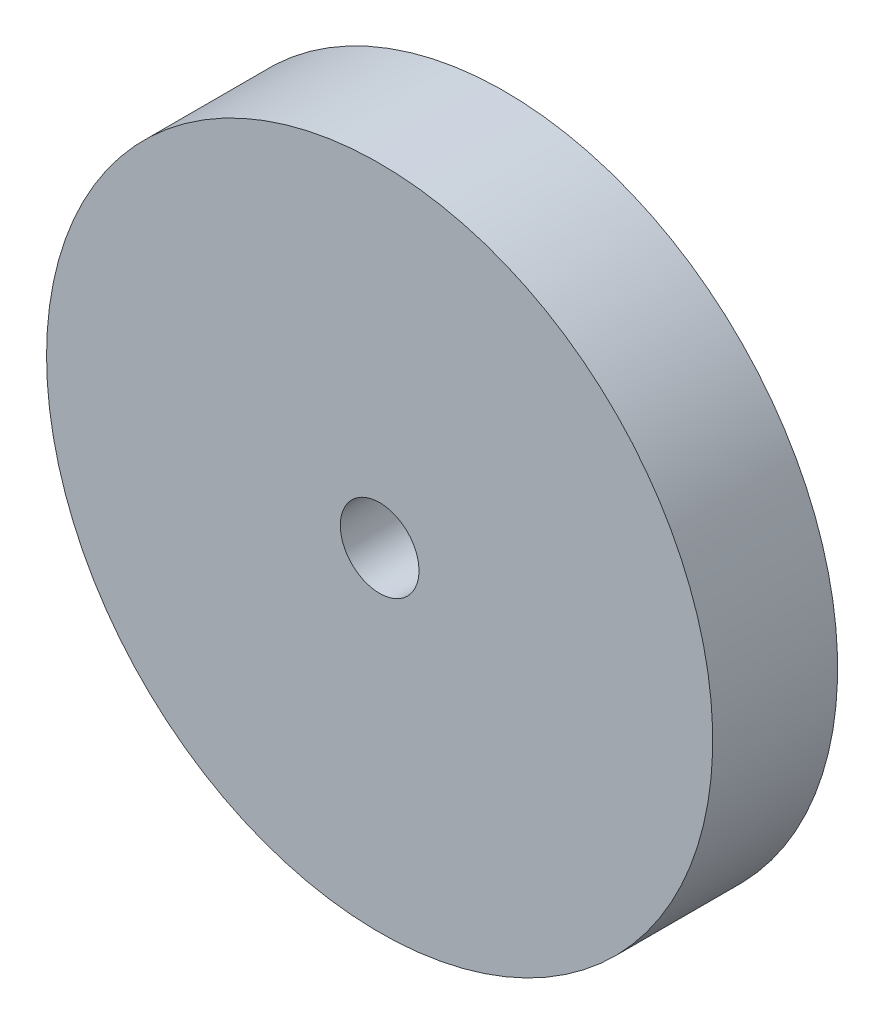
ISO-10303-21;
HEADER;
FILE_DESCRIPTION(('STEP AP214'),'2;1');
FILE_NAME('part.step','',(''),(''),'','','');
FILE_SCHEMA(('AUTOMOTIVE_DESIGN { 1 0 10303 214 1 1 1 1 }'));
ENDSEC;
DATA;
#1=APPLICATION_CONTEXT('core data for automotive mechanical design processes');
#2=APPLICATION_PROTOCOL_DEFINITION('international standard','automotive_design',2000,#1);
#3=PRODUCT_CONTEXT('',#1,'mechanical');
#4=PRODUCT('Part','Part','',(#3));
#5=PRODUCT_RELATED_PRODUCT_CATEGORY('part','',(#4));
#6=PRODUCT_DEFINITION_FORMATION('','',#4);
#7=PRODUCT_DEFINITION_CONTEXT('part definition',#1,'design');
#8=PRODUCT_DEFINITION('design','',#6,#7);
#9=PRODUCT_DEFINITION_SHAPE('','',#8);
#10=(LENGTH_UNIT() NAMED_UNIT(*) SI_UNIT(.MILLI.,.METRE.));
#11=(NAMED_UNIT(*) PLANE_ANGLE_UNIT() SI_UNIT($,.RADIAN.));
#12=(NAMED_UNIT(*) SI_UNIT($,.STERADIAN.) SOLID_ANGLE_UNIT());
#13=UNCERTAINTY_MEASURE_WITH_UNIT(LENGTH_MEASURE(1.E-05),#10,'distance_accuracy_value','');
#14=(GEOMETRIC_REPRESENTATION_CONTEXT(3) GLOBAL_UNCERTAINTY_ASSIGNED_CONTEXT((#13)) GLOBAL_UNIT_ASSIGNED_CONTEXT((#10,
#11,#12)) REPRESENTATION_CONTEXT('',''));
#15=CARTESIAN_POINT('',(0.,0.,0.));
#16=DIRECTION('',(0.,0.,1.));
#17=DIRECTION('',(1.,0.,0.));
#18=AXIS2_PLACEMENT_3D('',#15,#16,#17);
#19=CARTESIAN_POINT('',(0.,0.,9.525));
#20=DIRECTION('',(0.,0.,1.));
#21=DIRECTION('',(1.,0.,0.));
#22=AXIS2_PLACEMENT_3D('',#19,#20,#21);
#23=PLANE('',#22);
#24=CARTESIAN_POINT('',(0.,0.,9.525));
#25=DIRECTION('',(0.,0.,1.));
#26=DIRECTION('',(1.,0.,0.));
#27=AXIS2_PLACEMENT_3D('',#24,#25,#26);
#28=CIRCLE('',#27,25.4);
#29=CARTESIAN_POINT('',(-25.4,0.,9.525));
#30=VERTEX_POINT('',#29);
#31=EDGE_CURVE('E10',#30,#30,#28,.T.);
#32=ORIENTED_EDGE('',*,*,#31,.T.);
#33=EDGE_LOOP('',(#32));
#34=FACE_BOUND('',#33,.T.);
#35=CARTESIAN_POINT('',(0.,0.,9.525));
#36=DIRECTION('',(0.,0.,1.));
#37=DIRECTION('',(1.,0.,0.));
#38=AXIS2_PLACEMENT_3D('',#35,#36,#37);
#39=CIRCLE('',#38,3.);
#40=CARTESIAN_POINT('',(-3.,0.,9.525));
#41=VERTEX_POINT('',#40);
#42=EDGE_CURVE('E42',#41,#41,#39,.T.);
#43=ORIENTED_EDGE('',*,*,#42,.F.);
#44=EDGE_LOOP('',(#43));
#45=FACE_BOUND('',#44,.T.);
#46=ADVANCED_FACE('F31',(#34,#45),#23,.T.);
#47=CARTESIAN_POINT('',(0.,0.,0.));
#48=DIRECTION('',(0.,0.,1.));
#49=DIRECTION('',(1.,0.,0.));
#50=AXIS2_PLACEMENT_3D('',#47,#48,#49);
#51=PLANE('',#50);
#52=CARTESIAN_POINT('',(0.,0.,0.));
#53=DIRECTION('',(0.,0.,1.));
#54=DIRECTION('',(1.,0.,0.));
#55=AXIS2_PLACEMENT_3D('',#52,#53,#54);
#56=CIRCLE('',#55,25.4);
#57=CARTESIAN_POINT('',(-25.4,0.,0.));
#58=VERTEX_POINT('',#57);
#59=EDGE_CURVE('E35',#58,#58,#56,.T.);
#60=ORIENTED_EDGE('',*,*,#59,.F.);
#61=EDGE_LOOP('',(#60));
#62=FACE_BOUND('',#61,.T.);
#63=CARTESIAN_POINT('',(0.,0.,0.));
#64=DIRECTION('',(0.,0.,1.));
#65=DIRECTION('',(1.,0.,0.));
#66=AXIS2_PLACEMENT_3D('',#63,#64,#65);
#67=CIRCLE('',#66,3.);
#68=CARTESIAN_POINT('',(-3.,0.,0.));
#69=VERTEX_POINT('',#68);
#70=EDGE_CURVE('E44',#69,#69,#67,.T.);
#71=ORIENTED_EDGE('',*,*,#70,.T.);
#72=EDGE_LOOP('',(#71));
#73=FACE_BOUND('',#72,.T.);
#74=ADVANCED_FACE('F54',(#62,#73),#51,.F.);
#75=CARTESIAN_POINT('',(0.,0.,9.525));
#76=DIRECTION('',(0.,0.,-1.));
#77=DIRECTION('',(-1.,0.,0.));
#78=AXIS2_PLACEMENT_3D('',#75,#76,#77);
#79=CYLINDRICAL_SURFACE('',#78,25.4);
#80=CARTESIAN_POINT('',(-25.4,0.,9.525));
#81=CARTESIAN_POINT('',(-25.4,0.,9.42578125));
#82=CARTESIAN_POINT('',(-25.4,0.,9.3265625));
#83=CARTESIAN_POINT('',(-25.4,0.,9.128125));
#84=CARTESIAN_POINT('',(-25.4,0.,9.02890625));
#85=CARTESIAN_POINT('',(-25.4,0.,8.83046875));
#86=CARTESIAN_POINT('',(-25.4,0.,8.73125));
#87=CARTESIAN_POINT('',(-25.4,0.,8.5328125));
#88=CARTESIAN_POINT('',(-25.4,0.,8.43359375));
#89=CARTESIAN_POINT('',(-25.4,0.,8.23515625));
#90=CARTESIAN_POINT('',(-25.4,0.,8.1359375));
#91=CARTESIAN_POINT('',(-25.4,0.,7.9375));
#92=CARTESIAN_POINT('',(-25.4,0.,7.83828125));
#93=CARTESIAN_POINT('',(-25.4,0.,7.63984375));
#94=CARTESIAN_POINT('',(-25.4,0.,7.540625));
#95=CARTESIAN_POINT('',(-25.4,0.,7.3421875));
#96=CARTESIAN_POINT('',(-25.4,0.,7.24296875));
#97=CARTESIAN_POINT('',(-25.4,0.,7.04453125));
#98=CARTESIAN_POINT('',(-25.4,0.,6.9453125));
#99=CARTESIAN_POINT('',(-25.4,0.,6.746875));
#100=CARTESIAN_POINT('',(-25.4,0.,6.64765625));
#101=CARTESIAN_POINT('',(-25.4,0.,6.44921875));
#102=CARTESIAN_POINT('',(-25.4,0.,6.35));
#103=CARTESIAN_POINT('',(-25.4,0.,6.1515625));
#104=CARTESIAN_POINT('',(-25.4,0.,6.05234375));
#105=CARTESIAN_POINT('',(-25.4,0.,5.85390625));
#106=CARTESIAN_POINT('',(-25.4,0.,5.7546875));
#107=CARTESIAN_POINT('',(-25.4,0.,5.55625));
#108=CARTESIAN_POINT('',(-25.4,0.,5.45703125));
#109=CARTESIAN_POINT('',(-25.4,0.,5.25859375));
#110=CARTESIAN_POINT('',(-25.4,0.,5.159375));
#111=CARTESIAN_POINT('',(-25.4,0.,4.9609375));
#112=CARTESIAN_POINT('',(-25.4,0.,4.86171875));
#113=CARTESIAN_POINT('',(-25.4,0.,4.66328125));
#114=CARTESIAN_POINT('',(-25.4,0.,4.5640625));
#115=CARTESIAN_POINT('',(-25.4,0.,4.365625));
#116=CARTESIAN_POINT('',(-25.4,0.,4.26640625));
#117=CARTESIAN_POINT('',(-25.4,0.,4.06796875));
#118=CARTESIAN_POINT('',(-25.4,0.,3.96875));
#119=CARTESIAN_POINT('',(-25.4,0.,3.7703125));
#120=CARTESIAN_POINT('',(-25.4,0.,3.67109375));
#121=CARTESIAN_POINT('',(-25.4,0.,3.47265625));
#122=CARTESIAN_POINT('',(-25.4,0.,3.3734375));
#123=CARTESIAN_POINT('',(-25.4,0.,3.175));
#124=CARTESIAN_POINT('',(-25.4,0.,3.07578125));
#125=CARTESIAN_POINT('',(-25.4,0.,2.87734375));
#126=CARTESIAN_POINT('',(-25.4,0.,2.778125));
#127=CARTESIAN_POINT('',(-25.4,0.,2.5796875));
#128=CARTESIAN_POINT('',(-25.4,0.,2.48046875));
#129=CARTESIAN_POINT('',(-25.4,0.,2.28203125));
#130=CARTESIAN_POINT('',(-25.4,0.,2.1828125));
#131=CARTESIAN_POINT('',(-25.4,0.,1.984375));
#132=CARTESIAN_POINT('',(-25.4,0.,1.88515625));
#133=CARTESIAN_POINT('',(-25.4,0.,1.68671875));
#134=CARTESIAN_POINT('',(-25.4,0.,1.5875));
#135=CARTESIAN_POINT('',(-25.4,0.,1.3890625));
#136=CARTESIAN_POINT('',(-25.4,0.,1.28984375));
#137=CARTESIAN_POINT('',(-25.4,0.,1.09140625));
#138=CARTESIAN_POINT('',(-25.4,0.,0.992187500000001));
#139=CARTESIAN_POINT('',(-25.4,0.,0.793750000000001));
#140=CARTESIAN_POINT('',(-25.4,0.,0.69453125));
#141=CARTESIAN_POINT('',(-25.4,0.,0.49609375));
#142=CARTESIAN_POINT('',(-25.4,0.,0.396875));
#143=CARTESIAN_POINT('',(-25.4,0.,0.1984375));
#144=CARTESIAN_POINT('',(-25.4,0.,0.0992187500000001));
#145=CARTESIAN_POINT('',(-25.4,0.,0.));
#146=B_SPLINE_CURVE_WITH_KNOTS('',3,(#80,#81,#82,#83,#84,#85,#86,#87,#88,#89,#90,#91,#92,#93,
#94,#95,#96,#97,#98,#99,#100,#101,#102,#103,#104,#105,#106,#107,#108,#109,#110,#111,#112,#113,
#114,#115,#116,#117,#118,#119,#120,#121,#122,#123,#124,#125,#126,#127,#128,#129,#130,#131,#132,
#133,#134,#135,#136,#137,#138,#139,#140,#141,#142,#143,#144,#145),.UNSPECIFIED.,.F.,.F.,(4,2,2,
2,2,2,2,2,2,2,2,2,2,2,2,2,2,2,2,2,2,2,2,2,2,2,2,2,2,2,2,2,4),(0.,0.297656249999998,
0.595312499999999,0.892968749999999,1.190625,1.48828125,1.7859375,2.08359375,2.38125,2.67890625,
2.9765625,3.27421875,3.571875,3.86953125,4.1671875,4.46484375,4.7625,5.06015625,5.3578125,
5.65546875,5.953125,6.25078125,6.5484375,6.84609375,7.14375,7.44140625,7.7390625,8.03671875,
8.334375,8.63203125,8.9296875,9.22734375,9.525),.UNSPECIFIED.);
#147=EDGE_CURVE('BSEAM33',#30,#58,#146,.T.);
#148=ORIENTED_EDGE('',*,*,#31,.F.);
#149=ORIENTED_EDGE('',*,*,#59,.T.);
#150=ORIENTED_EDGE('',*,*,#147,.T.);
#151=ORIENTED_EDGE('',*,*,#147,.F.);
#152=EDGE_LOOP('',(#148,#150,#149,#151));
#153=FACE_BOUND('',#152,.T.);
#154=ADVANCED_FACE('F33',(#153),#79,.T.);
#155=CARTESIAN_POINT('',(0.,0.,9.525));
#156=DIRECTION('',(0.,0.,-1.));
#157=DIRECTION('',(-1.,0.,0.));
#158=AXIS2_PLACEMENT_3D('',#155,#156,#157);
#159=CYLINDRICAL_SURFACE('',#158,3.);
#160=CARTESIAN_POINT('',(-3.,0.,9.525));
#161=CARTESIAN_POINT('',(-3.,0.,9.42578125));
#162=CARTESIAN_POINT('',(-3.,0.,9.3265625));
#163=CARTESIAN_POINT('',(-3.,0.,9.128125));
#164=CARTESIAN_POINT('',(-3.,0.,9.02890625));
#165=CARTESIAN_POINT('',(-3.,0.,8.83046875));
#166=CARTESIAN_POINT('',(-3.,0.,8.73125));
#167=CARTESIAN_POINT('',(-3.,0.,8.5328125));
#168=CARTESIAN_POINT('',(-3.,0.,8.43359375));
#169=CARTESIAN_POINT('',(-3.,0.,8.23515625));
#170=CARTESIAN_POINT('',(-3.,0.,8.1359375));
#171=CARTESIAN_POINT('',(-3.,0.,7.9375));
#172=CARTESIAN_POINT('',(-3.,0.,7.83828125));
#173=CARTESIAN_POINT('',(-3.,0.,7.63984375));
#174=CARTESIAN_POINT('',(-3.,0.,7.540625));
#175=CARTESIAN_POINT('',(-3.,0.,7.3421875));
#176=CARTESIAN_POINT('',(-3.,0.,7.24296875));
#177=CARTESIAN_POINT('',(-3.,0.,7.04453125));
#178=CARTESIAN_POINT('',(-3.,0.,6.9453125));
#179=CARTESIAN_POINT('',(-3.,0.,6.746875));
#180=CARTESIAN_POINT('',(-3.,0.,6.64765625));
#181=CARTESIAN_POINT('',(-3.,0.,6.44921875));
#182=CARTESIAN_POINT('',(-3.,0.,6.35));
#183=CARTESIAN_POINT('',(-3.,0.,6.1515625));
#184=CARTESIAN_POINT('',(-3.,0.,6.05234375));
#185=CARTESIAN_POINT('',(-3.,0.,5.85390625));
#186=CARTESIAN_POINT('',(-3.,0.,5.7546875));
#187=CARTESIAN_POINT('',(-3.,0.,5.55625));
#188=CARTESIAN_POINT('',(-3.,0.,5.45703125));
#189=CARTESIAN_POINT('',(-3.,0.,5.25859375));
#190=CARTESIAN_POINT('',(-3.,0.,5.159375));
#191=CARTESIAN_POINT('',(-3.,0.,4.9609375));
#192=CARTESIAN_POINT('',(-3.,0.,4.86171875));
#193=CARTESIAN_POINT('',(-3.,0.,4.66328125));
#194=CARTESIAN_POINT('',(-3.,0.,4.5640625));
#195=CARTESIAN_POINT('',(-3.,0.,4.365625));
#196=CARTESIAN_POINT('',(-3.,0.,4.26640625));
#197=CARTESIAN_POINT('',(-3.,0.,4.06796875));
#198=CARTESIAN_POINT('',(-3.,0.,3.96875));
#199=CARTESIAN_POINT('',(-3.,0.,3.7703125));
#200=CARTESIAN_POINT('',(-3.,0.,3.67109375));
#201=CARTESIAN_POINT('',(-3.,0.,3.47265625));
#202=CARTESIAN_POINT('',(-3.,0.,3.3734375));
#203=CARTESIAN_POINT('',(-3.,0.,3.175));
#204=CARTESIAN_POINT('',(-3.,0.,3.07578125));
#205=CARTESIAN_POINT('',(-3.,0.,2.87734375));
#206=CARTESIAN_POINT('',(-3.,0.,2.778125));
#207=CARTESIAN_POINT('',(-3.,0.,2.5796875));
#208=CARTESIAN_POINT('',(-3.,0.,2.48046875));
#209=CARTESIAN_POINT('',(-3.,0.,2.28203125));
#210=CARTESIAN_POINT('',(-3.,0.,2.1828125));
#211=CARTESIAN_POINT('',(-3.,0.,1.984375));
#212=CARTESIAN_POINT('',(-3.,0.,1.88515625));
#213=CARTESIAN_POINT('',(-3.,0.,1.68671875));
#214=CARTESIAN_POINT('',(-3.,0.,1.5875));
#215=CARTESIAN_POINT('',(-3.,0.,1.3890625));
#216=CARTESIAN_POINT('',(-3.,0.,1.28984375));
#217=CARTESIAN_POINT('',(-3.,0.,1.09140625));
#218=CARTESIAN_POINT('',(-3.,0.,0.992187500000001));
#219=CARTESIAN_POINT('',(-3.,0.,0.793750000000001));
#220=CARTESIAN_POINT('',(-3.,0.,0.69453125));
#221=CARTESIAN_POINT('',(-3.,0.,0.49609375));
#222=CARTESIAN_POINT('',(-3.,0.,0.396875));
#223=CARTESIAN_POINT('',(-3.,0.,0.1984375));
#224=CARTESIAN_POINT('',(-3.,0.,0.0992187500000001));
#225=CARTESIAN_POINT('',(-3.,0.,0.));
#226=B_SPLINE_CURVE_WITH_KNOTS('',3,(#160,#161,#162,#163,#164,#165,#166,#167,#168,#169,#170,
#171,#172,#173,#174,#175,#176,#177,#178,#179,#180,#181,#182,#183,#184,#185,#186,#187,#188,#189,
#190,#191,#192,#193,#194,#195,#196,#197,#198,#199,#200,#201,#202,#203,#204,#205,#206,#207,#208,
#209,#210,#211,#212,#213,#214,#215,#216,#217,#218,#219,#220,#221,#222,#223,#224,#225),
.UNSPECIFIED.,.F.,.F.,(4,2,2,2,2,2,2,2,2,2,2,2,2,2,2,2,2,2,2,2,2,2,2,2,2,2,2,2,2,2,2,2,4),(0.,
0.297656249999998,0.595312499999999,0.892968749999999,1.190625,1.48828125,1.7859375,2.08359375,
2.38125,2.67890625,2.9765625,3.27421875,3.571875,3.86953125,4.1671875,4.46484375,4.7625,
5.06015625,5.3578125,5.65546875,5.953125,6.25078125,6.5484375,6.84609375,7.14375,7.44140625,
7.7390625,8.03671875,8.334375,8.63203125,8.9296875,9.22734375,9.525),.UNSPECIFIED.);
#227=EDGE_CURVE('BSEAM50',#41,#69,#226,.T.);
#228=ORIENTED_EDGE('',*,*,#42,.T.);
#229=ORIENTED_EDGE('',*,*,#70,.F.);
#230=ORIENTED_EDGE('',*,*,#227,.T.);
#231=ORIENTED_EDGE('',*,*,#227,.F.);
#232=EDGE_LOOP('',(#228,#230,#229,#231));
#233=FACE_BOUND('',#232,.T.);
#234=ADVANCED_FACE('F50',(#233),#159,.F.);
#235=CLOSED_SHELL('',(#46,#74,#154,#234));
#236=MANIFOLD_SOLID_BREP('B2',#235);
#237=ADVANCED_BREP_SHAPE_REPRESENTATION('',(#18,#236),#14);
#238=SHAPE_DEFINITION_REPRESENTATION(#9,#237);
ENDSEC;
END-ISO-10303-21;
